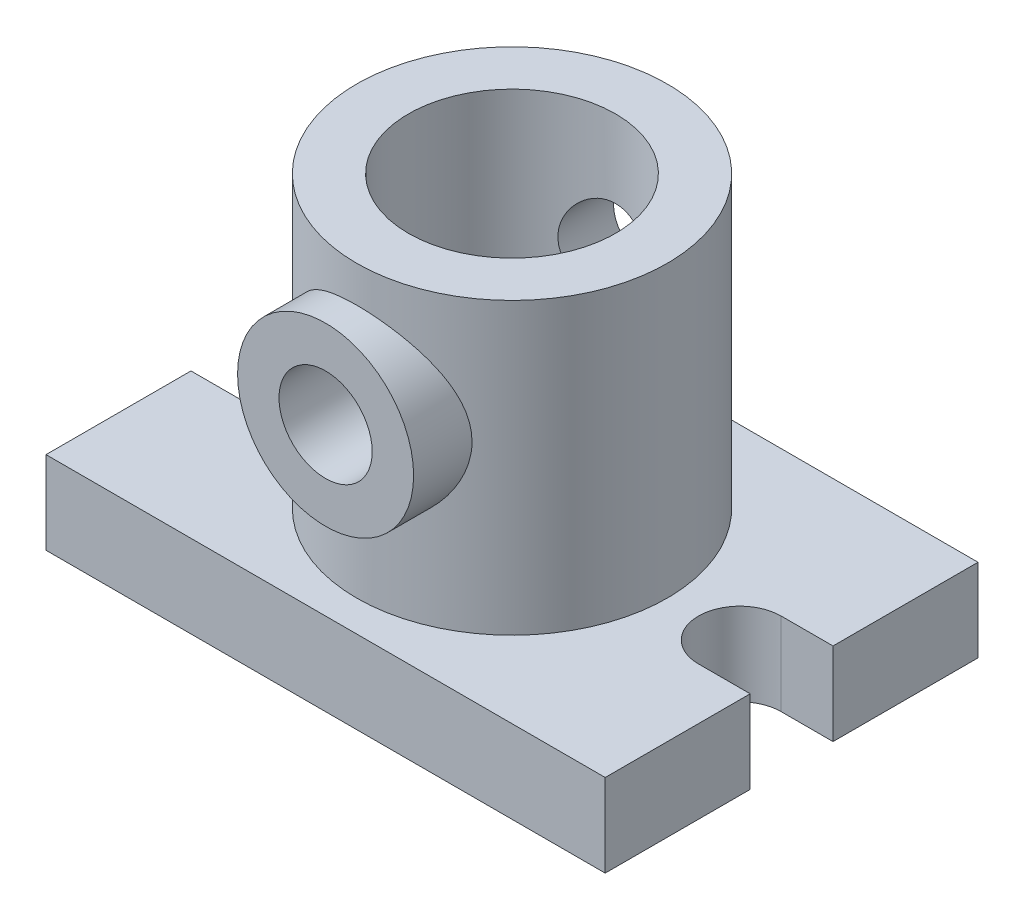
from build123d import *

# Parameters (mm, degrees)
SKETCH_1_R           = 4.5
EXTRUDE_1_DEPTH      = 8
SKETCH_2_R           = 15
SKETCH_2_R_2         = 4.5
EXTRUDE_2_DEPTH      = 36
SKETCH_3_R           = 10
CUT_EXTRUDE_1_DEPTH  = 23
EXTRUDE_3_REACH      = 59.628
EXTRUDE_3_END_RADIUS = 15
SKETCH_4_R           = 8.5
SKETCH_5_R           = 4.5
CUT_EXTRUDE_2_DEPTH  = 22.5


with BuildPart() as part:
    # Sketch 1 → Extrude 1 (new body)
    with BuildSketch(Plane(origin=(0, 0, 0), x_dir=(1, 0, 0), z_dir=(0, 1, 0))):
        with BuildLine():
            Line((-27, 4), (-27, 18))
            Line((-27, 18), (27, 18))
            Line((27, 18), (27, 4))
            Line((27, 4), (22, 4))
            ThreePointArc((22, 4), (18, 0), (22, -4))
            Line((22, -4), (27, -4))
            Line((27, -4), (27, -18))
            Line((27, -18), (-27, -18))
            Line((-27, -18), (-27, -4))
            Line((-27, -4), (-22, -4))
            ThreePointArc((-22, -4), (-18, 0), (-22, 4))
            Line((-22, 4), (-27, 4))
        make_face()
        with Locations(Location((0, 0, 0), (0, 0, 270))):
            Circle(SKETCH_1_R, mode=Mode.SUBTRACT)
    extrude(amount=EXTRUDE_1_DEPTH)

    # Sketch 2 → Extrude 2 (add)
    with BuildSketch(Plane(origin=(0, 0, 0), x_dir=(1, 0, 0), z_dir=(0, 1, 0))):
        with Locations(Location((0, 0, 0), (0, 0, 270))):
            Circle(SKETCH_2_R)
        with Locations(Location((0, 0, 0), (0, 0, 270))):
            Circle(SKETCH_2_R_2, mode=Mode.SUBTRACT)
    extrude(amount=EXTRUDE_2_DEPTH)

    # Sketch 3 → Cut-Extrude 1 (cut)
    with BuildSketch(Plane(origin=(0, 36, 0), x_dir=(1, 0, 0), z_dir=(0, 1, 0))):
        with Locations(Location((0, 0, 0), (0, 0, 270))):
            Circle(SKETCH_3_R)
    extrude(amount=-CUT_EXTRUDE_1_DEPTH, mode=Mode.SUBTRACT)

    # Extrude 3: up to this cylinder (the profile starts outside it)
    extrude_3_end = Plane(origin=(0, 24, 0), z_dir=(0, -1, 0)) * Cylinder(EXTRUDE_3_END_RADIUS, 150.256, mode=Mode.PRIVATE)
    # Sketch 4 → Extrude 3 (add, up to the surface)
    with BuildSketch(Plane.XY.offset(18), mode=Mode.PRIVATE) as extrude_3_sk1:
        with Locations((0, 24)):
            Circle(SKETCH_4_R)
    extrude_3_tool1 = extrude(extrude_3_sk1.sketch, amount=-EXTRUDE_3_REACH, mode=Mode.PRIVATE) - extrude_3_end
    add(extrude_3_tool1.solids().sort_by_distance((0, 24, 18))[0])

    # Sketch 5 → Cut-Extrude 2 (cut, symmetric)
    with BuildSketch(Plane.XY):
        with Locations((0, 24)):
            Circle(SKETCH_5_R)
    extrude(amount=CUT_EXTRUDE_2_DEPTH, both=True, mode=Mode.SUBTRACT)


solid = part.part
